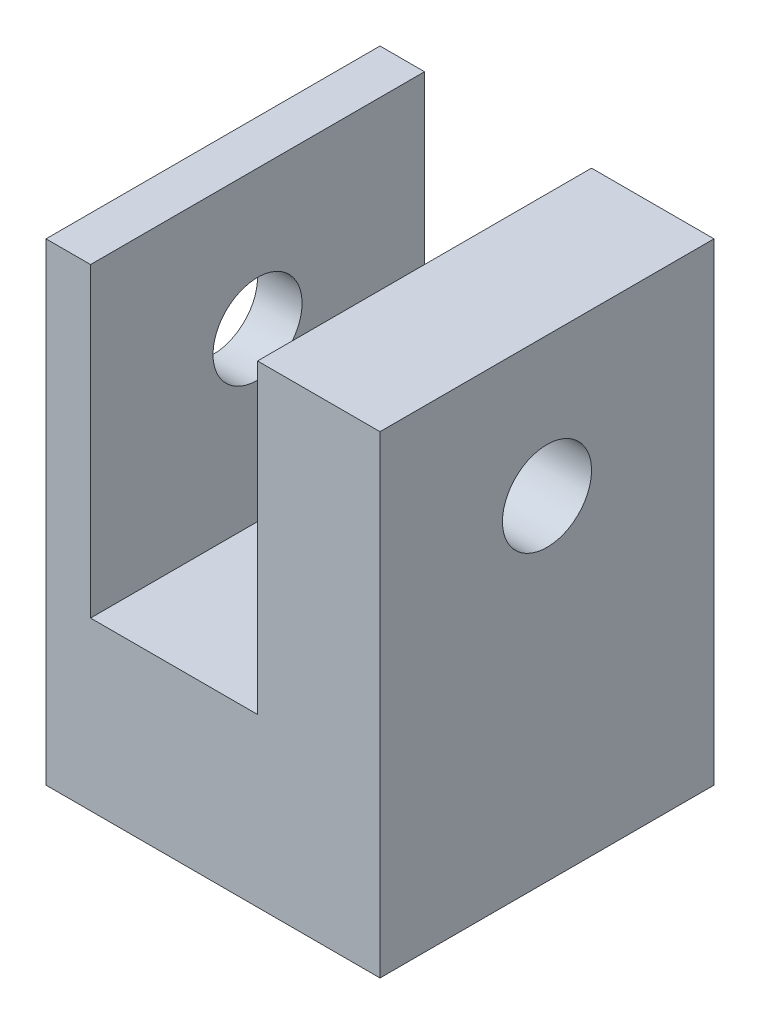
ISO-10303-21;
HEADER;
FILE_DESCRIPTION(('STEP AP214'),'2;1');
FILE_NAME('part.step','',(''),(''),'','','');
FILE_SCHEMA(('AUTOMOTIVE_DESIGN { 1 0 10303 214 1 1 1 1 }'));
ENDSEC;
DATA;
#1=APPLICATION_CONTEXT('core data for automotive mechanical design processes');
#2=APPLICATION_PROTOCOL_DEFINITION('international standard','automotive_design',2000,#1);
#3=PRODUCT_CONTEXT('',#1,'mechanical');
#4=PRODUCT('Part','Part','',(#3));
#5=PRODUCT_RELATED_PRODUCT_CATEGORY('part','',(#4));
#6=PRODUCT_DEFINITION_FORMATION('','',#4);
#7=PRODUCT_DEFINITION_CONTEXT('part definition',#1,'design');
#8=PRODUCT_DEFINITION('design','',#6,#7);
#9=PRODUCT_DEFINITION_SHAPE('','',#8);
#10=(LENGTH_UNIT() NAMED_UNIT(*) SI_UNIT(.MILLI.,.METRE.));
#11=(NAMED_UNIT(*) PLANE_ANGLE_UNIT() SI_UNIT($,.RADIAN.));
#12=(NAMED_UNIT(*) SI_UNIT($,.STERADIAN.) SOLID_ANGLE_UNIT());
#13=UNCERTAINTY_MEASURE_WITH_UNIT(LENGTH_MEASURE(1.E-05),#10,'distance_accuracy_value','');
#14=(GEOMETRIC_REPRESENTATION_CONTEXT(3) GLOBAL_UNCERTAINTY_ASSIGNED_CONTEXT((#13)) GLOBAL_UNIT_ASSIGNED_CONTEXT((#10,
#11,#12)) REPRESENTATION_CONTEXT('',''));
#15=CARTESIAN_POINT('',(0.,0.,0.));
#16=DIRECTION('',(0.,0.,1.));
#17=DIRECTION('',(1.,0.,0.));
#18=AXIS2_PLACEMENT_3D('',#15,#16,#17);
#19=CARTESIAN_POINT('',(45.7002653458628,29.6684350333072,30.));
#20=DIRECTION('',(-1.,0.,0.));
#21=DIRECTION('',(0.,0.,1.));
#22=AXIS2_PLACEMENT_3D('',#19,#20,#21);
#23=CYLINDRICAL_SURFACE('',#22,8.);
#24=CARTESIAN_POINT('',(45.7002653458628,29.6684350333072,30.));
#25=DIRECTION('',(-1.,0.,0.));
#26=DIRECTION('',(0.,0.,1.));
#27=AXIS2_PLACEMENT_3D('',#24,#25,#26);
#28=CIRCLE('',#27,8.);
#29=CARTESIAN_POINT('',(45.7002653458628,29.6684350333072,38.));
#30=VERTEX_POINT('',#29);
#31=EDGE_CURVE('E101',#30,#30,#28,.T.);
#32=ORIENTED_EDGE('',*,*,#31,.F.);
#33=EDGE_LOOP('',(#32));
#34=FACE_BOUND('',#33,.T.);
#35=CARTESIAN_POINT('',(23.7002653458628,29.6684350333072,30.));
#36=DIRECTION('',(-1.,0.,0.));
#37=DIRECTION('',(0.,0.,1.));
#38=AXIS2_PLACEMENT_3D('',#35,#36,#37);
#39=CIRCLE('',#38,8.);
#40=CARTESIAN_POINT('',(23.7002653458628,29.6684350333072,38.));
#41=VERTEX_POINT('',#40);
#42=EDGE_CURVE('E20',#41,#41,#39,.F.);
#43=ORIENTED_EDGE('',*,*,#42,.F.);
#44=EDGE_LOOP('',(#43));
#45=FACE_BOUND('',#44,.T.);
#46=ADVANCED_FACE('F16',(#34,#45),#23,.F.);
#47=CARTESIAN_POINT('',(23.7002653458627,54.6684350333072,0.));
#48=DIRECTION('',(0.,1.,0.));
#49=DIRECTION('',(0.,0.,1.));
#50=AXIS2_PLACEMENT_3D('',#47,#48,#49);
#51=PLANE('',#50);
#52=DIRECTION('',(1.,0.,0.));
#53=VECTOR('',#52,1.);
#54=CARTESIAN_POINT('',(13.7752653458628,54.6684350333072,0.));
#55=LINE('',#54,#53);
#56=CARTESIAN_POINT('',(45.7002653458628,54.6684350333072,0.));
#57=VERTEX_POINT('',#56);
#58=CARTESIAN_POINT('',(23.7002653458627,54.6684350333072,0.));
#59=VERTEX_POINT('',#58);
#60=EDGE_CURVE('E132',#57,#59,#55,.F.);
#61=ORIENTED_EDGE('',*,*,#60,.T.);
#62=DIRECTION('',(0.,0.,1.));
#63=VECTOR('',#62,1.);
#64=CARTESIAN_POINT('',(23.7002653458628,54.6684350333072,0.));
#65=LINE('',#64,#63);
#66=CARTESIAN_POINT('',(23.7002653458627,54.6684350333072,60.));
#67=VERTEX_POINT('',#66);
#68=EDGE_CURVE('E161',#67,#59,#65,.F.);
#69=ORIENTED_EDGE('',*,*,#68,.F.);
#70=DIRECTION('',(1.,0.,0.));
#71=VECTOR('',#70,1.);
#72=CARTESIAN_POINT('',(13.7752653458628,54.6684350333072,60.));
#73=LINE('',#72,#71);
#74=CARTESIAN_POINT('',(45.7002653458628,54.6684350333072,60.));
#75=VERTEX_POINT('',#74);
#76=EDGE_CURVE('E116',#75,#67,#73,.F.);
#77=ORIENTED_EDGE('',*,*,#76,.F.);
#78=DIRECTION('',(0.,0.,-1.));
#79=VECTOR('',#78,1.);
#80=CARTESIAN_POINT('',(45.7002653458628,54.6684350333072,0.));
#81=LINE('',#80,#79);
#82=EDGE_CURVE('E152',#57,#75,#81,.F.);
#83=ORIENTED_EDGE('',*,*,#82,.F.);
#84=EDGE_LOOP('',(#61,#69,#77,#83));
#85=FACE_BOUND('',#84,.T.);
#86=ADVANCED_FACE('F171',(#85),#51,.T.);
#87=CARTESIAN_POINT('',(23.7002653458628,-0.331564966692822,0.));
#88=DIRECTION('',(-1.,0.,0.));
#89=DIRECTION('',(0.,0.,1.));
#90=AXIS2_PLACEMENT_3D('',#87,#88,#89);
#91=PLANE('',#90);
#92=ORIENTED_EDGE('',*,*,#42,.T.);
#93=EDGE_LOOP('',(#92));
#94=FACE_BOUND('',#93,.T.);
#95=DIRECTION('',(0.,1.,0.));
#96=VECTOR('',#95,1.);
#97=CARTESIAN_POINT('',(23.7002653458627,12.1684350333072,0.));
#98=LINE('',#97,#96);
#99=CARTESIAN_POINT('',(23.7002653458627,-0.331564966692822,0.));
#100=VERTEX_POINT('',#99);
#101=EDGE_CURVE('E130',#59,#100,#98,.F.);
#102=ORIENTED_EDGE('',*,*,#101,.T.);
#103=DIRECTION('',(0.,0.,1.));
#104=VECTOR('',#103,1.);
#105=CARTESIAN_POINT('',(23.7002653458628,-0.331564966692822,0.));
#106=LINE('',#105,#104);
#107=CARTESIAN_POINT('',(23.7002653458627,-0.331564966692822,60.));
#108=VERTEX_POINT('',#107);
#109=EDGE_CURVE('E155',#108,#100,#106,.F.);
#110=ORIENTED_EDGE('',*,*,#109,.F.);
#111=DIRECTION('',(0.,1.,0.));
#112=VECTOR('',#111,1.);
#113=CARTESIAN_POINT('',(23.7002653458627,12.1684350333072,60.));
#114=LINE('',#113,#112);
#115=EDGE_CURVE('E114',#67,#108,#114,.F.);
#116=ORIENTED_EDGE('',*,*,#115,.F.);
#117=ORIENTED_EDGE('',*,*,#68,.T.);
#118=EDGE_LOOP('',(#102,#110,#116,#117));
#119=FACE_BOUND('',#118,.T.);
#120=ADVANCED_FACE('F168',(#94,#119),#91,.T.);
#121=CARTESIAN_POINT('',(-6.29973465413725,-0.331564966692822,0.));
#122=DIRECTION('',(0.,1.,0.));
#123=DIRECTION('',(0.,0.,1.));
#124=AXIS2_PLACEMENT_3D('',#121,#122,#123);
#125=PLANE('',#124);
#126=DIRECTION('',(1.,0.,0.));
#127=VECTOR('',#126,1.);
#128=CARTESIAN_POINT('',(13.7752653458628,-0.331564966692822,0.));
#129=LINE('',#128,#127);
#130=CARTESIAN_POINT('',(-6.29973465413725,-0.331564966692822,0.));
#131=VERTEX_POINT('',#130);
#132=EDGE_CURVE('E97',#100,#131,#129,.F.);
#133=ORIENTED_EDGE('',*,*,#132,.T.);
#134=DIRECTION('',(0.,0.,-1.));
#135=VECTOR('',#134,1.);
#136=CARTESIAN_POINT('',(-6.29973465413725,-0.331564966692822,0.));
#137=LINE('',#136,#135);
#138=CARTESIAN_POINT('',(-6.29973465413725,-0.331564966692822,60.));
#139=VERTEX_POINT('',#138);
#140=EDGE_CURVE('E89',#139,#131,#137,.T.);
#141=ORIENTED_EDGE('',*,*,#140,.F.);
#142=DIRECTION('',(1.,0.,0.));
#143=VECTOR('',#142,1.);
#144=CARTESIAN_POINT('',(13.7752653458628,-0.331564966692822,60.));
#145=LINE('',#144,#143);
#146=EDGE_CURVE('E94',#108,#139,#145,.F.);
#147=ORIENTED_EDGE('',*,*,#146,.F.);
#148=ORIENTED_EDGE('',*,*,#109,.T.);
#149=EDGE_LOOP('',(#133,#141,#147,#148));
#150=FACE_BOUND('',#149,.T.);
#151=ADVANCED_FACE('F91',(#150),#125,.T.);
#152=CARTESIAN_POINT('',(45.7002653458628,54.6684350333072,0.));
#153=DIRECTION('',(1.,0.,0.));
#154=DIRECTION('',(0.,0.,-1.));
#155=AXIS2_PLACEMENT_3D('',#152,#153,#154);
#156=PLANE('',#155);
#157=ORIENTED_EDGE('',*,*,#31,.T.);
#158=EDGE_LOOP('',(#157));
#159=FACE_BOUND('',#158,.T.);
#160=DIRECTION('',(0.,1.,0.));
#161=VECTOR('',#160,1.);
#162=CARTESIAN_POINT('',(45.7002653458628,12.1684350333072,0.));
#163=LINE('',#162,#161);
#164=CARTESIAN_POINT('',(45.7002653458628,-30.3315649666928,0.));
#165=VERTEX_POINT('',#164);
#166=EDGE_CURVE('E53',#165,#57,#163,.T.);
#167=ORIENTED_EDGE('',*,*,#166,.T.);
#168=ORIENTED_EDGE('',*,*,#82,.T.);
#169=DIRECTION('',(0.,1.,0.));
#170=VECTOR('',#169,1.);
#171=CARTESIAN_POINT('',(45.7002653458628,12.1684350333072,60.));
#172=LINE('',#171,#170);
#173=CARTESIAN_POINT('',(45.7002653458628,-30.3315649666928,60.));
#174=VERTEX_POINT('',#173);
#175=EDGE_CURVE('E100',#174,#75,#172,.T.);
#176=ORIENTED_EDGE('',*,*,#175,.F.);
#177=DIRECTION('',(0.,0.,-1.));
#178=VECTOR('',#177,1.);
#179=CARTESIAN_POINT('',(45.7002653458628,-30.3315649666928,0.));
#180=LINE('',#179,#178);
#181=EDGE_CURVE('E135',#165,#174,#180,.F.);
#182=ORIENTED_EDGE('',*,*,#181,.F.);
#183=EDGE_LOOP('',(#167,#168,#176,#182));
#184=FACE_BOUND('',#183,.T.);
#185=ADVANCED_FACE('F202',(#159,#184),#156,.T.);
#186=CARTESIAN_POINT('',(-6.29973465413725,54.6684350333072,0.));
#187=DIRECTION('',(1.,0.,0.));
#188=DIRECTION('',(0.,0.,-1.));
#189=AXIS2_PLACEMENT_3D('',#186,#187,#188);
#190=PLANE('',#189);
#191=CARTESIAN_POINT('',(-6.29973465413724,29.6684350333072,30.));
#192=DIRECTION('',(-1.,0.,0.));
#193=DIRECTION('',(0.,-1.,0.));
#194=AXIS2_PLACEMENT_3D('',#191,#192,#193);
#195=CIRCLE('',#194,8.);
#196=CARTESIAN_POINT('',(-6.29973465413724,21.6684350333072,30.));
#197=VERTEX_POINT('',#196);
#198=EDGE_CURVE('E138',#197,#197,#195,.T.);
#199=ORIENTED_EDGE('',*,*,#198,.T.);
#200=EDGE_LOOP('',(#199));
#201=FACE_BOUND('',#200,.T.);
#202=DIRECTION('',(0.,1.,0.));
#203=VECTOR('',#202,1.);
#204=CARTESIAN_POINT('',(-6.29973465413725,12.1684350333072,0.));
#205=LINE('',#204,#203);
#206=CARTESIAN_POINT('',(-6.29973465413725,54.6684350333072,0.));
#207=VERTEX_POINT('',#206);
#208=EDGE_CURVE('E127',#131,#207,#205,.T.);
#209=ORIENTED_EDGE('',*,*,#208,.T.);
#210=DIRECTION('',(0.,0.,1.));
#211=VECTOR('',#210,1.);
#212=CARTESIAN_POINT('',(-6.29973465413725,54.6684350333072,0.));
#213=LINE('',#212,#211);
#214=CARTESIAN_POINT('',(-6.29973465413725,54.6684350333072,60.));
#215=VERTEX_POINT('',#214);
#216=EDGE_CURVE('E107',#215,#207,#213,.F.);
#217=ORIENTED_EDGE('',*,*,#216,.F.);
#218=DIRECTION('',(0.,1.,0.));
#219=VECTOR('',#218,1.);
#220=CARTESIAN_POINT('',(-6.29973465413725,12.1684350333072,60.));
#221=LINE('',#220,#219);
#222=EDGE_CURVE('E104',#139,#215,#221,.T.);
#223=ORIENTED_EDGE('',*,*,#222,.F.);
#224=ORIENTED_EDGE('',*,*,#140,.T.);
#225=EDGE_LOOP('',(#209,#217,#223,#224));
#226=FACE_BOUND('',#225,.T.);
#227=ADVANCED_FACE('F105',(#201,#226),#190,.T.);
#228=CARTESIAN_POINT('',(13.7752653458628,12.1684350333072,60.));
#229=DIRECTION('',(0.,0.,1.));
#230=DIRECTION('',(1.,0.,0.));
#231=AXIS2_PLACEMENT_3D('',#228,#229,#230);
#232=PLANE('',#231);
#233=ORIENTED_EDGE('',*,*,#146,.T.);
#234=ORIENTED_EDGE('',*,*,#222,.T.);
#235=DIRECTION('',(1.,0.,0.));
#236=VECTOR('',#235,1.);
#237=CARTESIAN_POINT('',(-14.2997346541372,54.6684350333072,60.));
#238=LINE('',#237,#236);
#239=CARTESIAN_POINT('',(-14.2997346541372,54.6684350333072,60.));
#240=VERTEX_POINT('',#239);
#241=EDGE_CURVE('E109',#240,#215,#238,.T.);
#242=ORIENTED_EDGE('',*,*,#241,.F.);
#243=DIRECTION('',(0.,1.,0.));
#244=VECTOR('',#243,1.);
#245=CARTESIAN_POINT('',(-14.2997346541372,-30.3315649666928,60.));
#246=LINE('',#245,#244);
#247=CARTESIAN_POINT('',(-14.2997346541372,-30.3315649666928,60.));
#248=VERTEX_POINT('',#247);
#249=EDGE_CURVE('E49',#248,#240,#246,.T.);
#250=ORIENTED_EDGE('',*,*,#249,.F.);
#251=DIRECTION('',(1.,0.,0.));
#252=VECTOR('',#251,1.);
#253=CARTESIAN_POINT('',(45.7002653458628,-30.3315649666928,60.));
#254=LINE('',#253,#252);
#255=EDGE_CURVE('E126',#174,#248,#254,.F.);
#256=ORIENTED_EDGE('',*,*,#255,.F.);
#257=ORIENTED_EDGE('',*,*,#175,.T.);
#258=ORIENTED_EDGE('',*,*,#76,.T.);
#259=ORIENTED_EDGE('',*,*,#115,.T.);
#260=EDGE_LOOP('',(#233,#234,#242,#250,#256,#257,#258,#259));
#261=FACE_BOUND('',#260,.T.);
#262=ADVANCED_FACE('F111',(#261),#232,.T.);
#263=CARTESIAN_POINT('',(-14.2997346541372,54.6684350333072,0.));
#264=DIRECTION('',(0.,1.,0.));
#265=DIRECTION('',(0.,0.,1.));
#266=AXIS2_PLACEMENT_3D('',#263,#264,#265);
#267=PLANE('',#266);
#268=DIRECTION('',(1.,0.,0.));
#269=VECTOR('',#268,1.);
#270=CARTESIAN_POINT('',(13.7752653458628,54.6684350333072,0.));
#271=LINE('',#270,#269);
#272=CARTESIAN_POINT('',(-14.2997346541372,54.6684350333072,0.));
#273=VERTEX_POINT('',#272);
#274=EDGE_CURVE('E124',#207,#273,#271,.F.);
#275=ORIENTED_EDGE('',*,*,#274,.T.);
#276=DIRECTION('',(0.,0.,1.));
#277=VECTOR('',#276,1.);
#278=CARTESIAN_POINT('',(-14.2997346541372,54.6684350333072,0.));
#279=LINE('',#278,#277);
#280=EDGE_CURVE('E146',#240,#273,#279,.F.);
#281=ORIENTED_EDGE('',*,*,#280,.F.);
#282=ORIENTED_EDGE('',*,*,#241,.T.);
#283=ORIENTED_EDGE('',*,*,#216,.T.);
#284=EDGE_LOOP('',(#275,#281,#282,#283));
#285=FACE_BOUND('',#284,.T.);
#286=ADVANCED_FACE('F194',(#285),#267,.T.);
#287=CARTESIAN_POINT('',(13.7752653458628,12.1684350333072,0.));
#288=DIRECTION('',(0.,0.,1.));
#289=DIRECTION('',(1.,0.,0.));
#290=AXIS2_PLACEMENT_3D('',#287,#288,#289);
#291=PLANE('',#290);
#292=ORIENTED_EDGE('',*,*,#274,.F.);
#293=ORIENTED_EDGE('',*,*,#208,.F.);
#294=ORIENTED_EDGE('',*,*,#132,.F.);
#295=ORIENTED_EDGE('',*,*,#101,.F.);
#296=ORIENTED_EDGE('',*,*,#60,.F.);
#297=ORIENTED_EDGE('',*,*,#166,.F.);
#298=DIRECTION('',(1.,0.,0.));
#299=VECTOR('',#298,1.);
#300=CARTESIAN_POINT('',(45.7002653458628,-30.3315649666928,0.));
#301=LINE('',#300,#299);
#302=CARTESIAN_POINT('',(-14.2997346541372,-30.3315649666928,0.));
#303=VERTEX_POINT('',#302);
#304=EDGE_CURVE('E35',#303,#165,#301,.T.);
#305=ORIENTED_EDGE('',*,*,#304,.F.);
#306=DIRECTION('',(0.,1.,0.));
#307=VECTOR('',#306,1.);
#308=CARTESIAN_POINT('',(-14.2997346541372,-30.3315649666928,0.));
#309=LINE('',#308,#307);
#310=EDGE_CURVE('E143',#273,#303,#309,.F.);
#311=ORIENTED_EDGE('',*,*,#310,.F.);
#312=EDGE_LOOP('',(#292,#293,#294,#295,#296,#297,#305,#311));
#313=FACE_BOUND('',#312,.T.);
#314=ADVANCED_FACE('F190',(#313),#291,.F.);
#315=CARTESIAN_POINT('',(45.7002653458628,-30.3315649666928,0.));
#316=DIRECTION('',(0.,-1.,0.));
#317=DIRECTION('',(0.,0.,-1.));
#318=AXIS2_PLACEMENT_3D('',#315,#316,#317);
#319=PLANE('',#318);
#320=ORIENTED_EDGE('',*,*,#304,.T.);
#321=ORIENTED_EDGE('',*,*,#181,.T.);
#322=ORIENTED_EDGE('',*,*,#255,.T.);
#323=DIRECTION('',(0.,0.,1.));
#324=VECTOR('',#323,1.);
#325=CARTESIAN_POINT('',(-14.2997346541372,-30.3315649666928,0.));
#326=LINE('',#325,#324);
#327=EDGE_CURVE('E26',#303,#248,#326,.T.);
#328=ORIENTED_EDGE('',*,*,#327,.F.);
#329=EDGE_LOOP('',(#320,#321,#322,#328));
#330=FACE_BOUND('',#329,.T.);
#331=ADVANCED_FACE('F184',(#330),#319,.T.);
#332=CARTESIAN_POINT('',(-6.29973465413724,29.6684350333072,30.));
#333=DIRECTION('',(-1.,0.,0.));
#334=DIRECTION('',(0.,-1.,0.));
#335=AXIS2_PLACEMENT_3D('',#332,#333,#334);
#336=CYLINDRICAL_SURFACE('',#335,8.);
#337=ORIENTED_EDGE('',*,*,#198,.F.);
#338=EDGE_LOOP('',(#337));
#339=FACE_BOUND('',#338,.T.);
#340=CARTESIAN_POINT('',(-14.2997346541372,29.6684350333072,30.));
#341=DIRECTION('',(-1.,0.,0.));
#342=DIRECTION('',(0.,-1.,0.));
#343=AXIS2_PLACEMENT_3D('',#340,#341,#342);
#344=CIRCLE('',#343,8.);
#345=CARTESIAN_POINT('',(-14.2997346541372,21.6684350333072,30.));
#346=VERTEX_POINT('',#345);
#347=EDGE_CURVE('E10',#346,#346,#344,.F.);
#348=ORIENTED_EDGE('',*,*,#347,.F.);
#349=EDGE_LOOP('',(#348));
#350=FACE_BOUND('',#349,.T.);
#351=ADVANCED_FACE('F18',(#339,#350),#336,.F.);
#352=CARTESIAN_POINT('',(-14.2997346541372,-30.3315649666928,0.));
#353=DIRECTION('',(-1.,0.,0.));
#354=DIRECTION('',(0.,0.,1.));
#355=AXIS2_PLACEMENT_3D('',#352,#353,#354);
#356=PLANE('',#355);
#357=ORIENTED_EDGE('',*,*,#347,.T.);
#358=EDGE_LOOP('',(#357));
#359=FACE_BOUND('',#358,.T.);
#360=ORIENTED_EDGE('',*,*,#310,.T.);
#361=ORIENTED_EDGE('',*,*,#327,.T.);
#362=ORIENTED_EDGE('',*,*,#249,.T.);
#363=ORIENTED_EDGE('',*,*,#280,.T.);
#364=EDGE_LOOP('',(#360,#361,#362,#363));
#365=FACE_BOUND('',#364,.T.);
#366=ADVANCED_FACE('F179',(#359,#365),#356,.T.);
#367=CLOSED_SHELL('',(#46,#86,#120,#151,#185,#227,#262,#286,#314,#331,#351,#366));
#368=MANIFOLD_SOLID_BREP('B1',#367);
#369=ADVANCED_BREP_SHAPE_REPRESENTATION('',(#18,#368),#14);
#370=SHAPE_DEFINITION_REPRESENTATION(#9,#369);
ENDSEC;
END-ISO-10303-21;
